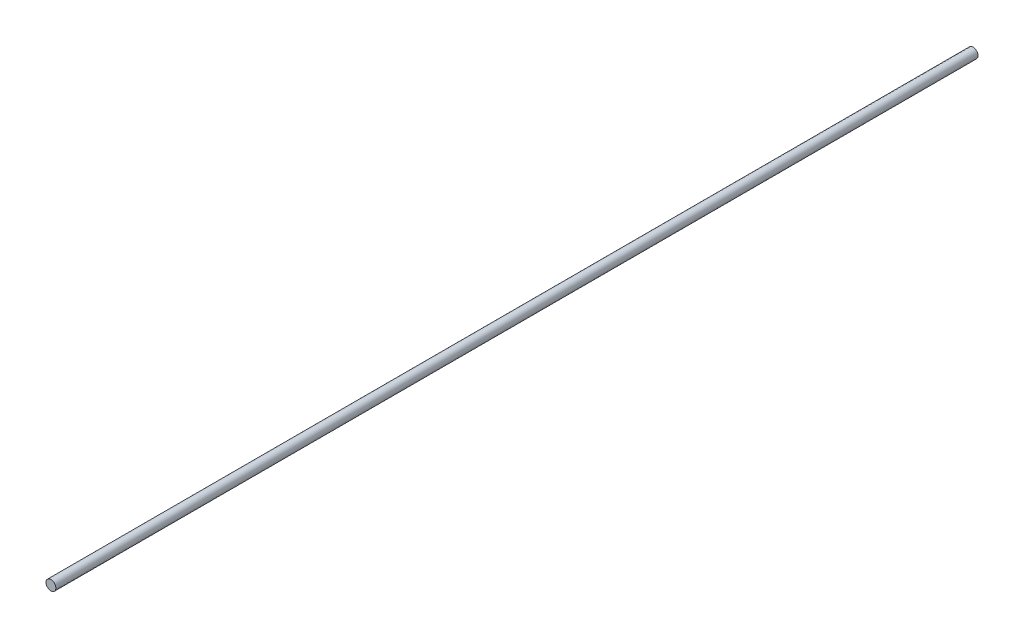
from build123d import *

# Parameters (mm, degrees)
SKETCH1_R           = 30
BOSS_EXTRUDE1_DEPTH = 5600


with BuildPart() as part:
    # Sketch1 → Boss-Extrude1 (new body)
    with BuildSketch(Plane.XY):
        Circle(SKETCH1_R)
    extrude(amount=-BOSS_EXTRUDE1_DEPTH)


solid = part.part
